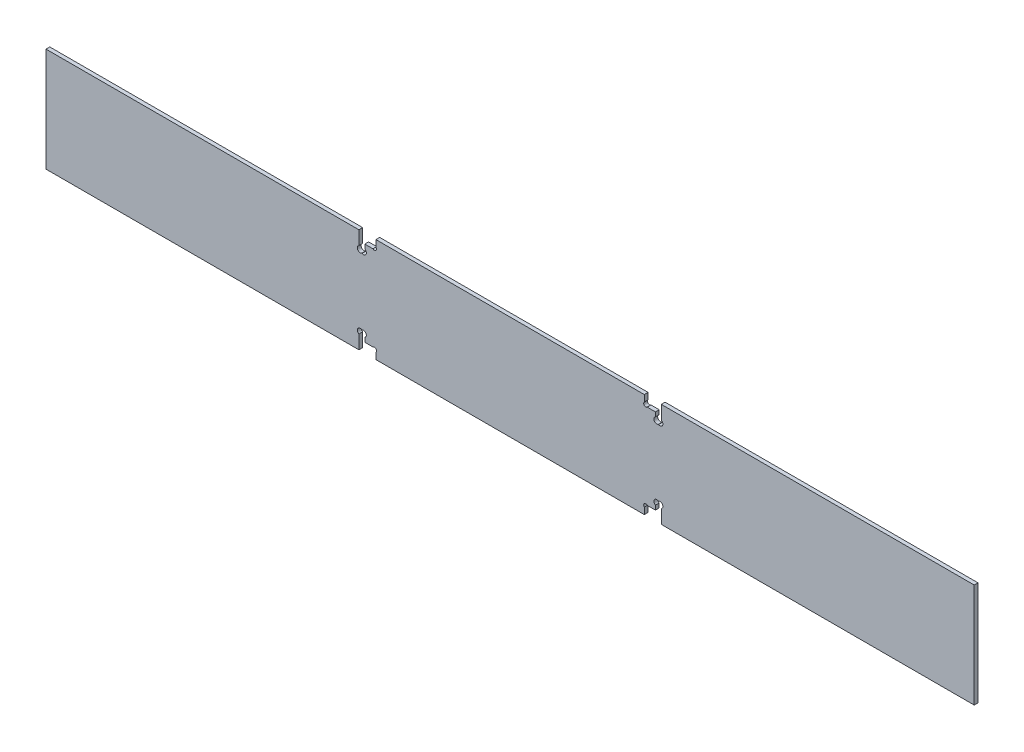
from build123d import *

# Parameters (mm, degrees)
EXTRUSION1_DEPTH = 2


with BuildPart() as part:
    # Esquisse1 → Extrusion1 (new body)
    with BuildSketch(Plane.XY):
        with BuildLine():
            Line((-0.5, 0), (165.014156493, 0))
            Line((165.014156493, 0), (165.014156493, 7.268862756))
            ThreePointArc((165.014156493, 7.268862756), (164.354878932, 9.38129284), (166.47954578, 10))
            Line((166.47954578, 10), (166.648767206, 10))
            ThreePointArc((166.648767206, 10), (168.773434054, 9.38129284), (168.114156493, 7.268862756))
            Line((168.114156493, 7.268862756), (168.114156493, 5))
            Line((168.114156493, 5), (172.444365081, 5))
            ThreePointArc((172.444365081, 5), (174.014156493, 5), (174.014156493, 3.430208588))
            Line((174.014156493, 3.430208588), (174.014156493, 0))
            Line((174.014156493, 0), (315.985843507, 0))
            Line((315.985843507, 0), (315.985843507, 3.430208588))
            ThreePointArc((315.985843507, 3.430208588), (315.985843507, 5), (317.555634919, 5))
            Line((317.555634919, 5), (321.885843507, 5))
            Line((321.885843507, 5), (321.885843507, 7.268862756))
            ThreePointArc((321.885843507, 7.268862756), (321.226565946, 9.38129284), (323.351232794, 10))
            Line((323.351232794, 10), (323.52045422, 10))
            ThreePointArc((323.52045422, 10), (325.645121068, 9.38129284), (324.985843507, 7.268862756))
            Line((324.985843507, 7.268862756), (324.985843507, 0))
            Line((324.985843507, 0), (490.5, 0))
            Line((490.5, 0), (490.5, 55))
            Line((490.5, 55), (324.985843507, 55))
            Line((324.985843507, 55), (324.985843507, 47.731137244))
            ThreePointArc((324.985843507, 47.731137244), (325.645121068, 45.61870716), (323.52045422, 45))
            Line((323.52045422, 45), (323.351232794, 45))
            ThreePointArc((323.351232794, 45), (321.226565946, 45.61870716), (321.885843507, 47.731137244))
            Line((321.885843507, 47.731137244), (321.885843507, 50))
            Line((321.885843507, 50), (317.555634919, 50))
            ThreePointArc((317.555634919, 50), (315.985843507, 50), (315.985843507, 51.569791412))
            Line((315.985843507, 51.569791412), (315.985843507, 55))
            Line((315.985843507, 55), (174.014156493, 55))
            Line((174.014156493, 55), (174.014156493, 51.569791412))
            ThreePointArc((174.014156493, 51.569791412), (174.014156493, 50), (172.444365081, 50))
            Line((172.444365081, 50), (168.114156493, 50))
            Line((168.114156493, 50), (168.114156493, 47.731137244))
            ThreePointArc((168.114156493, 47.731137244), (168.773434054, 45.61870716), (166.648767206, 45))
            Line((166.648767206, 45), (166.47954578, 45))
            ThreePointArc((166.47954578, 45), (164.354878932, 45.61870716), (165.014156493, 47.731137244))
            Line((165.014156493, 47.731137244), (165.014156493, 55))
            Line((165.014156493, 55), (-0.5, 55))
            Line((-0.5, 55), (-0.5, 0))
        make_face()
    extrude(amount=EXTRUSION1_DEPTH)


solid = part.part
